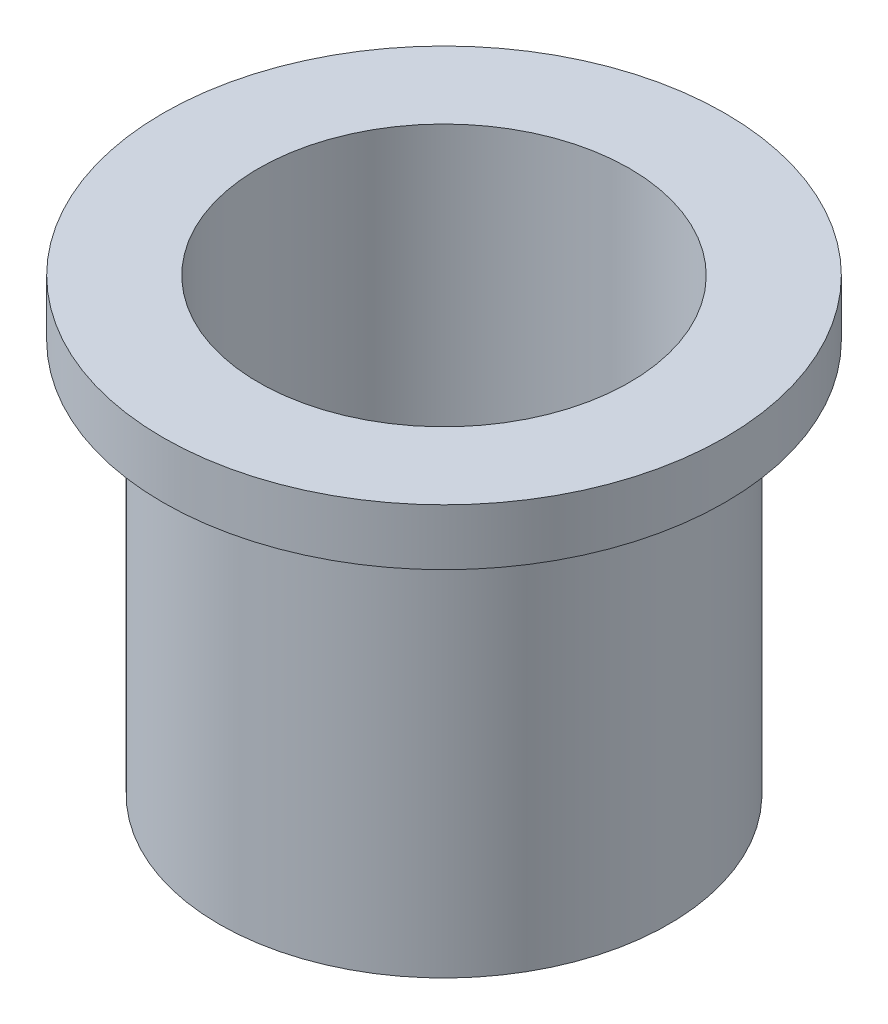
ISO-10303-21;
HEADER;
FILE_DESCRIPTION(('STEP AP214'),'2;1');
FILE_NAME('part.step','',(''),(''),'','','');
FILE_SCHEMA(('AUTOMOTIVE_DESIGN { 1 0 10303 214 1 1 1 1 }'));
ENDSEC;
DATA;
#1=APPLICATION_CONTEXT('core data for automotive mechanical design processes');
#2=APPLICATION_PROTOCOL_DEFINITION('international standard','automotive_design',2000,#1);
#3=PRODUCT_CONTEXT('',#1,'mechanical');
#4=PRODUCT('Part','Part','',(#3));
#5=PRODUCT_RELATED_PRODUCT_CATEGORY('part','',(#4));
#6=PRODUCT_DEFINITION_FORMATION('','',#4);
#7=PRODUCT_DEFINITION_CONTEXT('part definition',#1,'design');
#8=PRODUCT_DEFINITION('design','',#6,#7);
#9=PRODUCT_DEFINITION_SHAPE('','',#8);
#10=(LENGTH_UNIT() NAMED_UNIT(*) SI_UNIT(.MILLI.,.METRE.));
#11=(NAMED_UNIT(*) PLANE_ANGLE_UNIT() SI_UNIT($,.RADIAN.));
#12=(NAMED_UNIT(*) SI_UNIT($,.STERADIAN.) SOLID_ANGLE_UNIT());
#13=UNCERTAINTY_MEASURE_WITH_UNIT(LENGTH_MEASURE(1.E-05),#10,'distance_accuracy_value','');
#14=(GEOMETRIC_REPRESENTATION_CONTEXT(3) GLOBAL_UNCERTAINTY_ASSIGNED_CONTEXT((#13)) GLOBAL_UNIT_ASSIGNED_CONTEXT((#10,
#11,#12)) REPRESENTATION_CONTEXT('',''));
#15=CARTESIAN_POINT('',(0.,0.,0.));
#16=DIRECTION('',(0.,0.,1.));
#17=DIRECTION('',(1.,0.,0.));
#18=AXIS2_PLACEMENT_3D('',#15,#16,#17);
#19=CARTESIAN_POINT('',(0.,2.,0.));
#20=DIRECTION('',(0.,1.,0.));
#21=DIRECTION('',(0.,0.,1.));
#22=AXIS2_PLACEMENT_3D('',#19,#20,#21);
#23=PLANE('',#22);
#24=CARTESIAN_POINT('',(0.,2.,0.));
#25=DIRECTION('',(0.,1.,0.));
#26=DIRECTION('',(0.,0.,1.));
#27=AXIS2_PLACEMENT_3D('',#24,#25,#26);
#28=CIRCLE('',#27,2.5);
#29=CARTESIAN_POINT('',(0.,2.,2.5));
#30=VERTEX_POINT('',#29);
#31=EDGE_CURVE('E18',#30,#30,#28,.F.);
#32=ORIENTED_EDGE('',*,*,#31,.F.);
#33=EDGE_LOOP('',(#32));
#34=FACE_BOUND('',#33,.T.);
#35=CARTESIAN_POINT('',(0.,2.,0.));
#36=DIRECTION('',(0.,-1.,0.));
#37=DIRECTION('',(0.,0.,-1.));
#38=AXIS2_PLACEMENT_3D('',#35,#36,#37);
#39=CIRCLE('',#38,1.65);
#40=CARTESIAN_POINT('',(0.,2.,-1.65));
#41=VERTEX_POINT('',#40);
#42=EDGE_CURVE('E34',#41,#41,#39,.T.);
#43=ORIENTED_EDGE('',*,*,#42,.T.);
#44=EDGE_LOOP('',(#43));
#45=FACE_BOUND('',#44,.T.);
#46=ADVANCED_FACE('F15',(#34,#45),#23,.T.);
#47=CARTESIAN_POINT('',(0.,1.5,0.));
#48=DIRECTION('',(0.,1.,0.));
#49=DIRECTION('',(0.,0.,1.));
#50=AXIS2_PLACEMENT_3D('',#47,#48,#49);
#51=CYLINDRICAL_SURFACE('',#50,2.5);
#52=ORIENTED_EDGE('',*,*,#31,.T.);
#53=EDGE_LOOP('',(#52));
#54=FACE_BOUND('',#53,.T.);
#55=CARTESIAN_POINT('',(0.,1.5,0.));
#56=DIRECTION('',(0.,1.,0.));
#57=DIRECTION('',(0.,0.,1.));
#58=AXIS2_PLACEMENT_3D('',#55,#56,#57);
#59=CIRCLE('',#58,2.5);
#60=CARTESIAN_POINT('',(0.,1.5,2.5));
#61=VERTEX_POINT('',#60);
#62=EDGE_CURVE('E32',#61,#61,#59,.T.);
#63=ORIENTED_EDGE('',*,*,#62,.T.);
#64=EDGE_LOOP('',(#63));
#65=FACE_BOUND('',#64,.T.);
#66=ADVANCED_FACE('F41',(#54,#65),#51,.T.);
#67=CARTESIAN_POINT('',(0.,2.,0.));
#68=DIRECTION('',(0.,-1.,0.));
#69=DIRECTION('',(0.,0.,-1.));
#70=AXIS2_PLACEMENT_3D('',#67,#68,#69);
#71=CYLINDRICAL_SURFACE('',#70,1.65);
#72=ORIENTED_EDGE('',*,*,#42,.F.);
#73=EDGE_LOOP('',(#72));
#74=FACE_BOUND('',#73,.T.);
#75=CARTESIAN_POINT('',(0.,-2.,0.));
#76=DIRECTION('',(0.,-1.,0.));
#77=DIRECTION('',(0.,0.,-1.));
#78=AXIS2_PLACEMENT_3D('',#75,#76,#77);
#79=CIRCLE('',#78,1.65);
#80=CARTESIAN_POINT('',(0.,-2.,-1.65));
#81=VERTEX_POINT('',#80);
#82=EDGE_CURVE('E27',#81,#81,#79,.T.);
#83=ORIENTED_EDGE('',*,*,#82,.T.);
#84=EDGE_LOOP('',(#83));
#85=FACE_BOUND('',#84,.T.);
#86=ADVANCED_FACE('F49',(#74,#85),#71,.F.);
#87=CARTESIAN_POINT('',(0.,1.5,0.));
#88=DIRECTION('',(0.,1.,0.));
#89=DIRECTION('',(0.,0.,1.));
#90=AXIS2_PLACEMENT_3D('',#87,#88,#89);
#91=PLANE('',#90);
#92=CARTESIAN_POINT('',(0.,1.5,0.));
#93=DIRECTION('',(0.,-1.,0.));
#94=DIRECTION('',(0.,0.,-1.));
#95=AXIS2_PLACEMENT_3D('',#92,#93,#94);
#96=CIRCLE('',#95,2.);
#97=CARTESIAN_POINT('',(0.,1.5,-2.));
#98=VERTEX_POINT('',#97);
#99=EDGE_CURVE('E22',#98,#98,#96,.T.);
#100=ORIENTED_EDGE('',*,*,#99,.F.);
#101=EDGE_LOOP('',(#100));
#102=FACE_BOUND('',#101,.T.);
#103=ORIENTED_EDGE('',*,*,#62,.F.);
#104=EDGE_LOOP('',(#103));
#105=FACE_BOUND('',#104,.T.);
#106=ADVANCED_FACE('F57',(#102,#105),#91,.F.);
#107=CARTESIAN_POINT('',(0.,-2.,0.));
#108=DIRECTION('',(0.,1.,0.));
#109=DIRECTION('',(0.,0.,1.));
#110=AXIS2_PLACEMENT_3D('',#107,#108,#109);
#111=PLANE('',#110);
#112=ORIENTED_EDGE('',*,*,#82,.F.);
#113=EDGE_LOOP('',(#112));
#114=FACE_BOUND('',#113,.T.);
#115=CARTESIAN_POINT('',(0.,-2.,0.));
#116=DIRECTION('',(0.,-1.,0.));
#117=DIRECTION('',(0.,0.,-1.));
#118=AXIS2_PLACEMENT_3D('',#115,#116,#117);
#119=CIRCLE('',#118,2.);
#120=CARTESIAN_POINT('',(0.,-2.,-2.));
#121=VERTEX_POINT('',#120);
#122=EDGE_CURVE('E10',#121,#121,#119,.F.);
#123=ORIENTED_EDGE('',*,*,#122,.F.);
#124=EDGE_LOOP('',(#123));
#125=FACE_BOUND('',#124,.T.);
#126=ADVANCED_FACE('F52',(#114,#125),#111,.F.);
#127=CARTESIAN_POINT('',(0.,2.,0.));
#128=DIRECTION('',(0.,-1.,0.));
#129=DIRECTION('',(0.,0.,-1.));
#130=AXIS2_PLACEMENT_3D('',#127,#128,#129);
#131=CYLINDRICAL_SURFACE('',#130,2.);
#132=ORIENTED_EDGE('',*,*,#122,.T.);
#133=EDGE_LOOP('',(#132));
#134=FACE_BOUND('',#133,.T.);
#135=ORIENTED_EDGE('',*,*,#99,.T.);
#136=EDGE_LOOP('',(#135));
#137=FACE_BOUND('',#136,.T.);
#138=ADVANCED_FACE('F50',(#134,#137),#131,.T.);
#139=CLOSED_SHELL('',(#46,#66,#86,#106,#126,#138));
#140=MANIFOLD_SOLID_BREP('B1',#139);
#141=ADVANCED_BREP_SHAPE_REPRESENTATION('',(#18,#140),#14);
#142=SHAPE_DEFINITION_REPRESENTATION(#9,#141);
ENDSEC;
END-ISO-10303-21;
